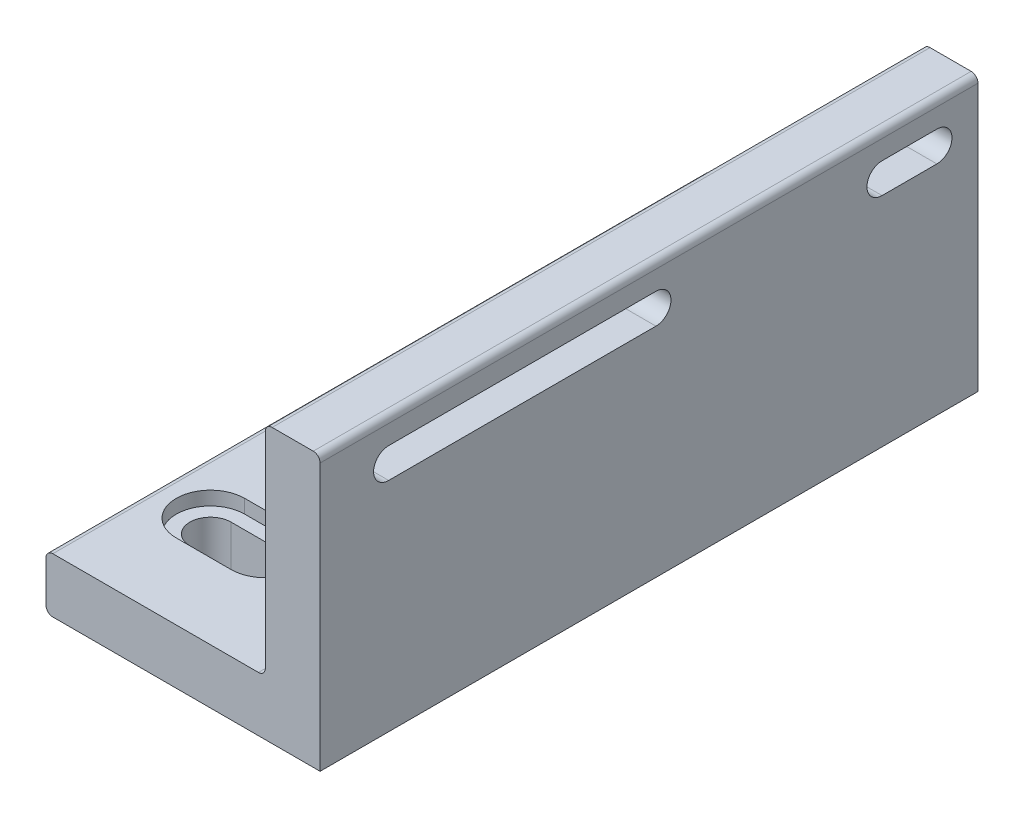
ISO-10303-21;
HEADER;
FILE_DESCRIPTION(('STEP AP214'),'2;1');
FILE_NAME('part.step','',(''),(''),'','','');
FILE_SCHEMA(('AUTOMOTIVE_DESIGN { 1 0 10303 214 1 1 1 1 }'));
ENDSEC;
DATA;
#1=APPLICATION_CONTEXT('core data for automotive mechanical design processes');
#2=APPLICATION_PROTOCOL_DEFINITION('international standard','automotive_design',2000,#1);
#3=PRODUCT_CONTEXT('',#1,'mechanical');
#4=PRODUCT('Part','Part','',(#3));
#5=PRODUCT_RELATED_PRODUCT_CATEGORY('part','',(#4));
#6=PRODUCT_DEFINITION_FORMATION('','',#4);
#7=PRODUCT_DEFINITION_CONTEXT('part definition',#1,'design');
#8=PRODUCT_DEFINITION('design','',#6,#7);
#9=PRODUCT_DEFINITION_SHAPE('','',#8);
#10=(LENGTH_UNIT() NAMED_UNIT(*) SI_UNIT(.MILLI.,.METRE.));
#11=(NAMED_UNIT(*) PLANE_ANGLE_UNIT() SI_UNIT($,.RADIAN.));
#12=(NAMED_UNIT(*) SI_UNIT($,.STERADIAN.) SOLID_ANGLE_UNIT());
#13=UNCERTAINTY_MEASURE_WITH_UNIT(LENGTH_MEASURE(1.E-05),#10,'distance_accuracy_value','');
#14=(GEOMETRIC_REPRESENTATION_CONTEXT(3) GLOBAL_UNCERTAINTY_ASSIGNED_CONTEXT((#13)) GLOBAL_UNIT_ASSIGNED_CONTEXT((#10,
#11,#12)) REPRESENTATION_CONTEXT('',''));
#15=CARTESIAN_POINT('',(0.,0.,0.));
#16=DIRECTION('',(0.,0.,1.));
#17=DIRECTION('',(1.,0.,0.));
#18=AXIS2_PLACEMENT_3D('',#15,#16,#17);
#19=CARTESIAN_POINT('',(-101.6,0.,101.6));
#20=DIRECTION('',(0.,1.,0.));
#21=DIRECTION('',(-1.,0.,0.));
#22=AXIS2_PLACEMENT_3D('',#19,#20,#21);
#23=CYLINDRICAL_SURFACE('',#22,9.52499999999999);
#24=CARTESIAN_POINT('',(-101.6,19.05,101.6));
#25=DIRECTION('',(0.,1.,0.));
#26=DIRECTION('',(-1.,0.,0.));
#27=AXIS2_PLACEMENT_3D('',#24,#25,#26);
#28=CIRCLE('',#27,9.52499999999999);
#29=CARTESIAN_POINT('',(-101.6,19.05,111.125));
#30=VERTEX_POINT('',#29);
#31=CARTESIAN_POINT('',(-101.6,19.05,92.075));
#32=VERTEX_POINT('',#31);
#33=EDGE_CURVE('E302',#30,#32,#28,.F.);
#34=ORIENTED_EDGE('',*,*,#33,.F.);
#35=DIRECTION('',(0.,1.,0.));
#36=VECTOR('',#35,1.);
#37=CARTESIAN_POINT('',(-101.6,0.,111.125));
#38=LINE('',#37,#36);
#39=CARTESIAN_POINT('',(-101.6,0.,111.125));
#40=VERTEX_POINT('',#39);
#41=EDGE_CURVE('E354',#40,#30,#38,.T.);
#42=ORIENTED_EDGE('',*,*,#41,.F.);
#43=CARTESIAN_POINT('',(-101.6,0.,101.6));
#44=DIRECTION('',(0.,1.,0.));
#45=DIRECTION('',(1.,0.,0.));
#46=AXIS2_PLACEMENT_3D('',#43,#44,#45);
#47=CIRCLE('',#46,9.52499999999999);
#48=CARTESIAN_POINT('',(-101.6,0.,92.075));
#49=VERTEX_POINT('',#48);
#50=EDGE_CURVE('E342',#49,#40,#47,.T.);
#51=ORIENTED_EDGE('',*,*,#50,.F.);
#52=DIRECTION('',(0.,1.,0.));
#53=VECTOR('',#52,1.);
#54=CARTESIAN_POINT('',(-101.6,0.,92.075));
#55=LINE('',#54,#53);
#56=EDGE_CURVE('E355',#49,#32,#55,.T.);
#57=ORIENTED_EDGE('',*,*,#56,.T.);
#58=EDGE_LOOP('',(#34,#42,#51,#57));
#59=FACE_BOUND('',#58,.T.);
#60=ADVANCED_FACE('F35',(#59),#23,.F.);
#61=CARTESIAN_POINT('',(-101.6,0.,92.075));
#62=DIRECTION('',(0.,0.,-1.));
#63=DIRECTION('',(-1.,0.,0.));
#64=AXIS2_PLACEMENT_3D('',#61,#62,#63);
#65=PLANE('',#64);
#66=DIRECTION('',(1.,0.,0.));
#67=VECTOR('',#66,1.);
#68=CARTESIAN_POINT('',(-101.6,19.05,92.075));
#69=LINE('',#68,#67);
#70=CARTESIAN_POINT('',(-76.1999999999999,19.05,92.075));
#71=VERTEX_POINT('',#70);
#72=EDGE_CURVE('E300',#32,#71,#69,.T.);
#73=ORIENTED_EDGE('',*,*,#72,.F.);
#74=ORIENTED_EDGE('',*,*,#56,.F.);
#75=DIRECTION('',(-1.,0.,0.));
#76=VECTOR('',#75,1.);
#77=CARTESIAN_POINT('',(-101.6,0.,92.075));
#78=LINE('',#77,#76);
#79=CARTESIAN_POINT('',(-76.1999999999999,0.,92.075));
#80=VERTEX_POINT('',#79);
#81=EDGE_CURVE('E351',#80,#49,#78,.T.);
#82=ORIENTED_EDGE('',*,*,#81,.F.);
#83=DIRECTION('',(0.,1.,0.));
#84=VECTOR('',#83,1.);
#85=CARTESIAN_POINT('',(-76.1999999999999,0.,92.075));
#86=LINE('',#85,#84);
#87=EDGE_CURVE('E359',#80,#71,#86,.T.);
#88=ORIENTED_EDGE('',*,*,#87,.T.);
#89=EDGE_LOOP('',(#73,#74,#82,#88));
#90=FACE_BOUND('',#89,.T.);
#91=ADVANCED_FACE('F562',(#90),#65,.F.);
#92=CARTESIAN_POINT('',(-76.2,0.,101.6));
#93=DIRECTION('',(0.,1.,0.));
#94=DIRECTION('',(-1.,0.,0.));
#95=AXIS2_PLACEMENT_3D('',#92,#93,#94);
#96=CYLINDRICAL_SURFACE('',#95,9.52499999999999);
#97=CARTESIAN_POINT('',(-76.2,19.05,101.6));
#98=DIRECTION('',(0.,1.,0.));
#99=DIRECTION('',(-1.,0.,0.));
#100=AXIS2_PLACEMENT_3D('',#97,#98,#99);
#101=CIRCLE('',#100,9.52499999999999);
#102=CARTESIAN_POINT('',(-76.1999999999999,19.05,111.125));
#103=VERTEX_POINT('',#102);
#104=EDGE_CURVE('E57',#71,#103,#101,.F.);
#105=ORIENTED_EDGE('',*,*,#104,.F.);
#106=ORIENTED_EDGE('',*,*,#87,.F.);
#107=CARTESIAN_POINT('',(-76.2,0.,101.6));
#108=DIRECTION('',(0.,1.,0.));
#109=DIRECTION('',(1.,0.,0.));
#110=AXIS2_PLACEMENT_3D('',#107,#108,#109);
#111=CIRCLE('',#110,9.52499999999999);
#112=CARTESIAN_POINT('',(-76.1999999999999,0.,111.125));
#113=VERTEX_POINT('',#112);
#114=EDGE_CURVE('E348',#113,#80,#111,.T.);
#115=ORIENTED_EDGE('',*,*,#114,.F.);
#116=DIRECTION('',(0.,1.,0.));
#117=VECTOR('',#116,1.);
#118=CARTESIAN_POINT('',(-76.1999999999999,0.,111.125));
#119=LINE('',#118,#117);
#120=EDGE_CURVE('E362',#113,#103,#119,.T.);
#121=ORIENTED_EDGE('',*,*,#120,.T.);
#122=EDGE_LOOP('',(#105,#106,#115,#121));
#123=FACE_BOUND('',#122,.T.);
#124=ADVANCED_FACE('F568',(#123),#96,.F.);
#125=CARTESIAN_POINT('',(-101.6,0.,111.125));
#126=DIRECTION('',(0.,0.,1.));
#127=DIRECTION('',(1.,0.,0.));
#128=AXIS2_PLACEMENT_3D('',#125,#126,#127);
#129=PLANE('',#128);
#130=DIRECTION('',(-1.,0.,0.));
#131=VECTOR('',#130,1.);
#132=CARTESIAN_POINT('',(-101.6,19.05,111.125));
#133=LINE('',#132,#131);
#134=EDGE_CURVE('E11',#103,#30,#133,.T.);
#135=ORIENTED_EDGE('',*,*,#134,.F.);
#136=ORIENTED_EDGE('',*,*,#120,.F.);
#137=DIRECTION('',(1.,0.,0.));
#138=VECTOR('',#137,1.);
#139=CARTESIAN_POINT('',(-101.6,0.,111.125));
#140=LINE('',#139,#138);
#141=EDGE_CURVE('E345',#40,#113,#140,.T.);
#142=ORIENTED_EDGE('',*,*,#141,.F.);
#143=ORIENTED_EDGE('',*,*,#41,.T.);
#144=EDGE_LOOP('',(#135,#136,#142,#143));
#145=FACE_BOUND('',#144,.T.);
#146=ADVANCED_FACE('F573',(#145),#129,.F.);
#147=CARTESIAN_POINT('',(-101.6,0.,-101.6));
#148=DIRECTION('',(0.,1.,0.));
#149=DIRECTION('',(-1.,0.,0.));
#150=AXIS2_PLACEMENT_3D('',#147,#148,#149);
#151=CYLINDRICAL_SURFACE('',#150,9.52499999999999);
#152=CARTESIAN_POINT('',(-101.6,19.05,-101.6));
#153=DIRECTION('',(0.,1.,0.));
#154=DIRECTION('',(-1.,0.,0.));
#155=AXIS2_PLACEMENT_3D('',#152,#153,#154);
#156=CIRCLE('',#155,9.52499999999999);
#157=CARTESIAN_POINT('',(-101.6,19.05,-92.075));
#158=VERTEX_POINT('',#157);
#159=CARTESIAN_POINT('',(-101.6,19.05,-111.125));
#160=VERTEX_POINT('',#159);
#161=EDGE_CURVE('E340',#158,#160,#156,.F.);
#162=ORIENTED_EDGE('',*,*,#161,.F.);
#163=DIRECTION('',(0.,1.,0.));
#164=VECTOR('',#163,1.);
#165=CARTESIAN_POINT('',(-101.6,0.,-92.075));
#166=LINE('',#165,#164);
#167=CARTESIAN_POINT('',(-101.6,0.,-92.075));
#168=VERTEX_POINT('',#167);
#169=EDGE_CURVE('E378',#168,#158,#166,.T.);
#170=ORIENTED_EDGE('',*,*,#169,.F.);
#171=CARTESIAN_POINT('',(-101.6,0.,-101.6));
#172=DIRECTION('',(0.,1.,0.));
#173=DIRECTION('',(-1.,0.,0.));
#174=AXIS2_PLACEMENT_3D('',#171,#172,#173);
#175=CIRCLE('',#174,9.52499999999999);
#176=CARTESIAN_POINT('',(-101.6,0.,-111.125));
#177=VERTEX_POINT('',#176);
#178=EDGE_CURVE('E358',#177,#168,#175,.T.);
#179=ORIENTED_EDGE('',*,*,#178,.F.);
#180=DIRECTION('',(0.,1.,0.));
#181=VECTOR('',#180,1.);
#182=CARTESIAN_POINT('',(-101.6,0.,-111.125));
#183=LINE('',#182,#181);
#184=EDGE_CURVE('E379',#177,#160,#183,.T.);
#185=ORIENTED_EDGE('',*,*,#184,.T.);
#186=EDGE_LOOP('',(#162,#170,#179,#185));
#187=FACE_BOUND('',#186,.T.);
#188=ADVANCED_FACE('F541',(#187),#151,.F.);
#189=CARTESIAN_POINT('',(-101.6,0.,-111.125));
#190=DIRECTION('',(0.,0.,-1.));
#191=DIRECTION('',(-1.,0.,0.));
#192=AXIS2_PLACEMENT_3D('',#189,#190,#191);
#193=PLANE('',#192);
#194=DIRECTION('',(1.,0.,0.));
#195=VECTOR('',#194,1.);
#196=CARTESIAN_POINT('',(-101.6,19.05,-111.125));
#197=LINE('',#196,#195);
#198=CARTESIAN_POINT('',(-76.1999999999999,19.05,-111.125));
#199=VERTEX_POINT('',#198);
#200=EDGE_CURVE('E338',#160,#199,#197,.T.);
#201=ORIENTED_EDGE('',*,*,#200,.F.);
#202=ORIENTED_EDGE('',*,*,#184,.F.);
#203=DIRECTION('',(-1.,0.,0.));
#204=VECTOR('',#203,1.);
#205=CARTESIAN_POINT('',(-101.6,0.,-111.125));
#206=LINE('',#205,#204);
#207=CARTESIAN_POINT('',(-76.1999999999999,0.,-111.125));
#208=VERTEX_POINT('',#207);
#209=EDGE_CURVE('E375',#208,#177,#206,.T.);
#210=ORIENTED_EDGE('',*,*,#209,.F.);
#211=DIRECTION('',(0.,1.,0.));
#212=VECTOR('',#211,1.);
#213=CARTESIAN_POINT('',(-76.1999999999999,0.,-111.125));
#214=LINE('',#213,#212);
#215=EDGE_CURVE('E383',#208,#199,#214,.T.);
#216=ORIENTED_EDGE('',*,*,#215,.T.);
#217=EDGE_LOOP('',(#201,#202,#210,#216));
#218=FACE_BOUND('',#217,.T.);
#219=ADVANCED_FACE('F550',(#218),#193,.F.);
#220=CARTESIAN_POINT('',(-76.2,0.,-101.6));
#221=DIRECTION('',(0.,1.,0.));
#222=DIRECTION('',(-1.,0.,0.));
#223=AXIS2_PLACEMENT_3D('',#220,#221,#222);
#224=CYLINDRICAL_SURFACE('',#223,9.52499999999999);
#225=CARTESIAN_POINT('',(-76.2,19.05,-101.6));
#226=DIRECTION('',(0.,1.,0.));
#227=DIRECTION('',(-1.,0.,0.));
#228=AXIS2_PLACEMENT_3D('',#225,#226,#227);
#229=CIRCLE('',#228,9.52499999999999);
#230=CARTESIAN_POINT('',(-76.1999999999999,19.05,-92.075));
#231=VERTEX_POINT('',#230);
#232=EDGE_CURVE('E330',#199,#231,#229,.F.);
#233=ORIENTED_EDGE('',*,*,#232,.F.);
#234=ORIENTED_EDGE('',*,*,#215,.F.);
#235=CARTESIAN_POINT('',(-76.2,0.,-101.6));
#236=DIRECTION('',(0.,1.,0.));
#237=DIRECTION('',(-1.,0.,0.));
#238=AXIS2_PLACEMENT_3D('',#235,#236,#237);
#239=CIRCLE('',#238,9.52499999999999);
#240=CARTESIAN_POINT('',(-76.1999999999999,0.,-92.075));
#241=VERTEX_POINT('',#240);
#242=EDGE_CURVE('E372',#241,#208,#239,.T.);
#243=ORIENTED_EDGE('',*,*,#242,.F.);
#244=DIRECTION('',(0.,1.,0.));
#245=VECTOR('',#244,1.);
#246=CARTESIAN_POINT('',(-76.1999999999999,0.,-92.075));
#247=LINE('',#246,#245);
#248=EDGE_CURVE('E386',#241,#231,#247,.T.);
#249=ORIENTED_EDGE('',*,*,#248,.T.);
#250=EDGE_LOOP('',(#233,#234,#243,#249));
#251=FACE_BOUND('',#250,.T.);
#252=ADVANCED_FACE('F552',(#251),#224,.F.);
#253=CARTESIAN_POINT('',(-101.6,0.,-92.075));
#254=DIRECTION('',(0.,0.,1.));
#255=DIRECTION('',(1.,0.,0.));
#256=AXIS2_PLACEMENT_3D('',#253,#254,#255);
#257=PLANE('',#256);
#258=DIRECTION('',(-1.,0.,0.));
#259=VECTOR('',#258,1.);
#260=CARTESIAN_POINT('',(-101.6,19.05,-92.075));
#261=LINE('',#260,#259);
#262=EDGE_CURVE('E43',#231,#158,#261,.T.);
#263=ORIENTED_EDGE('',*,*,#262,.F.);
#264=ORIENTED_EDGE('',*,*,#248,.F.);
#265=DIRECTION('',(1.,0.,0.));
#266=VECTOR('',#265,1.);
#267=CARTESIAN_POINT('',(-101.6,0.,-92.075));
#268=LINE('',#267,#266);
#269=EDGE_CURVE('E369',#168,#241,#268,.T.);
#270=ORIENTED_EDGE('',*,*,#269,.F.);
#271=ORIENTED_EDGE('',*,*,#169,.T.);
#272=EDGE_LOOP('',(#263,#264,#270,#271));
#273=FACE_BOUND('',#272,.T.);
#274=ADVANCED_FACE('F544',(#273),#257,.F.);
#275=CARTESIAN_POINT('',(0.,123.701968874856,152.4));
#276=DIRECTION('',(-1.,0.,0.));
#277=DIRECTION('',(0.,0.,1.));
#278=AXIS2_PLACEMENT_3D('',#275,#276,#277);
#279=PLANE('',#278);
#280=DIRECTION('',(0.,0.,1.));
#281=VECTOR('',#280,1.);
#282=CARTESIAN_POINT('',(0.,114.811968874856,-107.95));
#283=LINE('',#282,#281);
#284=CARTESIAN_POINT('',(0.,114.811968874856,-133.35));
#285=VERTEX_POINT('',#284);
#286=CARTESIAN_POINT('',(0.,114.811968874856,-107.95));
#287=VERTEX_POINT('',#286);
#288=EDGE_CURVE('E392',#285,#287,#283,.T.);
#289=ORIENTED_EDGE('',*,*,#288,.F.);
#290=CARTESIAN_POINT('',(0.,107.826968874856,-133.35));
#291=DIRECTION('',(1.,0.,0.));
#292=DIRECTION('',(0.,0.,-1.));
#293=AXIS2_PLACEMENT_3D('',#290,#291,#292);
#294=CIRCLE('',#293,6.98500000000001);
#295=CARTESIAN_POINT('',(0.,100.841968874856,-133.35));
#296=VERTEX_POINT('',#295);
#297=EDGE_CURVE('E382',#296,#285,#294,.T.);
#298=ORIENTED_EDGE('',*,*,#297,.F.);
#299=DIRECTION('',(0.,0.,-1.));
#300=VECTOR('',#299,1.);
#301=CARTESIAN_POINT('',(0.,100.841968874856,-107.95));
#302=LINE('',#301,#300);
#303=CARTESIAN_POINT('',(0.,100.841968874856,-107.95));
#304=VERTEX_POINT('',#303);
#305=EDGE_CURVE('E398',#304,#296,#302,.T.);
#306=ORIENTED_EDGE('',*,*,#305,.F.);
#307=CARTESIAN_POINT('',(0.,107.826968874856,-107.95));
#308=DIRECTION('',(1.,0.,0.));
#309=DIRECTION('',(0.,0.,-1.));
#310=AXIS2_PLACEMENT_3D('',#307,#308,#309);
#311=CIRCLE('',#310,6.985);
#312=EDGE_CURVE('E395',#287,#304,#311,.T.);
#313=ORIENTED_EDGE('',*,*,#312,.F.);
#314=EDGE_LOOP('',(#289,#298,#306,#313));
#315=FACE_BOUND('',#314,.T.);
#316=DIRECTION('',(0.,0.,-1.));
#317=VECTOR('',#316,1.);
#318=CARTESIAN_POINT('',(0.,100.841968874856,120.65));
#319=LINE('',#318,#317);
#320=CARTESIAN_POINT('',(0.,100.841968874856,120.65));
#321=VERTEX_POINT('',#320);
#322=CARTESIAN_POINT('',(0.,100.841968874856,-3.175));
#323=VERTEX_POINT('',#322);
#324=EDGE_CURVE('E412',#321,#323,#319,.T.);
#325=ORIENTED_EDGE('',*,*,#324,.F.);
#326=CARTESIAN_POINT('',(0.,107.826968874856,120.65));
#327=DIRECTION('',(1.,0.,0.));
#328=DIRECTION('',(0.,0.,-1.));
#329=AXIS2_PLACEMENT_3D('',#326,#327,#328);
#330=CIRCLE('',#329,6.985);
#331=CARTESIAN_POINT('',(0.,114.811968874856,120.65));
#332=VERTEX_POINT('',#331);
#333=EDGE_CURVE('E404',#332,#321,#330,.T.);
#334=ORIENTED_EDGE('',*,*,#333,.F.);
#335=DIRECTION('',(0.,0.,1.));
#336=VECTOR('',#335,1.);
#337=CARTESIAN_POINT('',(0.,114.811968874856,120.65));
#338=LINE('',#337,#336);
#339=CARTESIAN_POINT('',(0.,114.811968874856,-3.175));
#340=VERTEX_POINT('',#339);
#341=EDGE_CURVE('E418',#340,#332,#338,.T.);
#342=ORIENTED_EDGE('',*,*,#341,.F.);
#343=CARTESIAN_POINT('',(0.,107.826968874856,-3.175));
#344=DIRECTION('',(1.,0.,0.));
#345=DIRECTION('',(0.,0.,1.));
#346=AXIS2_PLACEMENT_3D('',#343,#344,#345);
#347=CIRCLE('',#346,6.985);
#348=EDGE_CURVE('E415',#323,#340,#347,.T.);
#349=ORIENTED_EDGE('',*,*,#348,.F.);
#350=EDGE_LOOP('',(#325,#334,#342,#349));
#351=FACE_BOUND('',#350,.T.);
#352=DIRECTION('',(0.,1.,0.));
#353=VECTOR('',#352,1.);
#354=CARTESIAN_POINT('',(0.,123.701968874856,-152.4));
#355=LINE('',#354,#353);
#356=CARTESIAN_POINT('',(0.,0.,-152.4));
#357=VERTEX_POINT('',#356);
#358=CARTESIAN_POINT('',(0.,123.701968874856,-152.4));
#359=VERTEX_POINT('',#358);
#360=EDGE_CURVE('E424',#357,#359,#355,.T.);
#361=ORIENTED_EDGE('',*,*,#360,.T.);
#362=DIRECTION('',(0.,0.,-1.));
#363=VECTOR('',#362,1.);
#364=CARTESIAN_POINT('',(0.,123.701968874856,152.4));
#365=LINE('',#364,#363);
#366=CARTESIAN_POINT('',(0.,123.701968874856,152.4));
#367=VERTEX_POINT('',#366);
#368=EDGE_CURVE('E506',#367,#359,#365,.T.);
#369=ORIENTED_EDGE('',*,*,#368,.F.);
#370=DIRECTION('',(0.,1.,0.));
#371=VECTOR('',#370,1.);
#372=CARTESIAN_POINT('',(0.,123.701968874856,152.4));
#373=LINE('',#372,#371);
#374=CARTESIAN_POINT('',(0.,0.,152.4));
#375=VERTEX_POINT('',#374);
#376=EDGE_CURVE('E431',#375,#367,#373,.T.);
#377=ORIENTED_EDGE('',*,*,#376,.F.);
#378=DIRECTION('',(0.,0.,-1.));
#379=VECTOR('',#378,1.);
#380=CARTESIAN_POINT('',(0.,0.,152.4));
#381=LINE('',#380,#379);
#382=EDGE_CURVE('E455',#375,#357,#381,.T.);
#383=ORIENTED_EDGE('',*,*,#382,.T.);
#384=EDGE_LOOP('',(#361,#369,#377,#383));
#385=FACE_BOUND('',#384,.T.);
#386=ADVANCED_FACE('F37',(#315,#351,#385),#279,.F.);
#387=CARTESIAN_POINT('',(-3.175,123.701968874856,152.4));
#388=DIRECTION('',(0.,0.,-1.));
#389=DIRECTION('',(-1.,0.,0.));
#390=AXIS2_PLACEMENT_3D('',#387,#388,#389);
#391=CYLINDRICAL_SURFACE('',#390,3.175);
#392=CARTESIAN_POINT('',(-3.175,123.701968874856,-152.4));
#393=DIRECTION('',(0.,0.,1.));
#394=DIRECTION('',(-1.,0.,0.));
#395=AXIS2_PLACEMENT_3D('',#392,#393,#394);
#396=CIRCLE('',#395,3.175);
#397=CARTESIAN_POINT('',(-3.175,126.876968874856,-152.4));
#398=VERTEX_POINT('',#397);
#399=EDGE_CURVE('E458',#359,#398,#396,.T.);
#400=ORIENTED_EDGE('',*,*,#399,.T.);
#401=DIRECTION('',(0.,0.,-1.));
#402=VECTOR('',#401,1.);
#403=CARTESIAN_POINT('',(-3.175,126.876968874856,152.4));
#404=LINE('',#403,#402);
#405=CARTESIAN_POINT('',(-3.175,126.876968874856,152.4));
#406=VERTEX_POINT('',#405);
#407=EDGE_CURVE('E503',#406,#398,#404,.T.);
#408=ORIENTED_EDGE('',*,*,#407,.F.);
#409=CARTESIAN_POINT('',(-3.175,123.701968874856,152.4));
#410=DIRECTION('',(0.,0.,1.));
#411=DIRECTION('',(-1.,0.,0.));
#412=AXIS2_PLACEMENT_3D('',#409,#410,#411);
#413=CIRCLE('',#412,3.175);
#414=EDGE_CURVE('E434',#367,#406,#413,.T.);
#415=ORIENTED_EDGE('',*,*,#414,.F.);
#416=ORIENTED_EDGE('',*,*,#368,.T.);
#417=EDGE_LOOP('',(#400,#408,#415,#416));
#418=FACE_BOUND('',#417,.T.);
#419=ADVANCED_FACE('F877',(#418),#391,.T.);
#420=CARTESIAN_POINT('',(-22.225,126.876968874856,152.4));
#421=DIRECTION('',(0.,-1.,0.));
#422=DIRECTION('',(0.,0.,-1.));
#423=AXIS2_PLACEMENT_3D('',#420,#421,#422);
#424=PLANE('',#423);
#425=DIRECTION('',(-1.,0.,0.));
#426=VECTOR('',#425,1.);
#427=CARTESIAN_POINT('',(-22.225,126.876968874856,-152.4));
#428=LINE('',#427,#426);
#429=CARTESIAN_POINT('',(-22.225,126.876968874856,-152.4));
#430=VERTEX_POINT('',#429);
#431=EDGE_CURVE('E460',#398,#430,#428,.T.);
#432=ORIENTED_EDGE('',*,*,#431,.T.);
#433=DIRECTION('',(0.,0.,-1.));
#434=VECTOR('',#433,1.);
#435=CARTESIAN_POINT('',(-22.225,126.876968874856,152.4));
#436=LINE('',#435,#434);
#437=CARTESIAN_POINT('',(-22.225,126.876968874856,152.4));
#438=VERTEX_POINT('',#437);
#439=EDGE_CURVE('E500',#438,#430,#436,.T.);
#440=ORIENTED_EDGE('',*,*,#439,.F.);
#441=DIRECTION('',(-1.,0.,0.));
#442=VECTOR('',#441,1.);
#443=CARTESIAN_POINT('',(-22.225,126.876968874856,152.4));
#444=LINE('',#443,#442);
#445=EDGE_CURVE('E437',#406,#438,#444,.T.);
#446=ORIENTED_EDGE('',*,*,#445,.F.);
#447=ORIENTED_EDGE('',*,*,#407,.T.);
#448=EDGE_LOOP('',(#432,#440,#446,#447));
#449=FACE_BOUND('',#448,.T.);
#450=ADVANCED_FACE('F868',(#449),#424,.F.);
#451=CARTESIAN_POINT('',(-22.225,123.701968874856,152.4));
#452=DIRECTION('',(0.,0.,-1.));
#453=DIRECTION('',(-1.,0.,0.));
#454=AXIS2_PLACEMENT_3D('',#451,#452,#453);
#455=CYLINDRICAL_SURFACE('',#454,3.175);
#456=CARTESIAN_POINT('',(-22.225,123.701968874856,-152.4));
#457=DIRECTION('',(0.,0.,1.));
#458=DIRECTION('',(-1.,0.,0.));
#459=AXIS2_PLACEMENT_3D('',#456,#457,#458);
#460=CIRCLE('',#459,3.175);
#461=CARTESIAN_POINT('',(-25.4,123.701968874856,-152.4));
#462=VERTEX_POINT('',#461);
#463=EDGE_CURVE('E462',#430,#462,#460,.T.);
#464=ORIENTED_EDGE('',*,*,#463,.T.);
#465=DIRECTION('',(0.,0.,-1.));
#466=VECTOR('',#465,1.);
#467=CARTESIAN_POINT('',(-25.4,123.701968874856,152.4));
#468=LINE('',#467,#466);
#469=CARTESIAN_POINT('',(-25.4,123.701968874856,152.4));
#470=VERTEX_POINT('',#469);
#471=EDGE_CURVE('E497',#470,#462,#468,.T.);
#472=ORIENTED_EDGE('',*,*,#471,.F.);
#473=CARTESIAN_POINT('',(-22.225,123.701968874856,152.4));
#474=DIRECTION('',(0.,0.,1.));
#475=DIRECTION('',(-1.,0.,0.));
#476=AXIS2_PLACEMENT_3D('',#473,#474,#475);
#477=CIRCLE('',#476,3.175);
#478=EDGE_CURVE('E439',#438,#470,#477,.T.);
#479=ORIENTED_EDGE('',*,*,#478,.F.);
#480=ORIENTED_EDGE('',*,*,#439,.T.);
#481=EDGE_LOOP('',(#464,#472,#479,#480));
#482=FACE_BOUND('',#481,.T.);
#483=ADVANCED_FACE('F860',(#482),#455,.T.);
#484=CARTESIAN_POINT('',(-25.4,28.575,152.4));
#485=DIRECTION('',(1.,0.,0.));
#486=DIRECTION('',(0.,0.,-1.));
#487=AXIS2_PLACEMENT_3D('',#484,#485,#486);
#488=PLANE('',#487);
#489=DIRECTION('',(0.,0.,-1.));
#490=VECTOR('',#489,1.);
#491=CARTESIAN_POINT('',(-25.4,100.841968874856,152.4));
#492=LINE('',#491,#490);
#493=CARTESIAN_POINT('',(-25.4,100.841968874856,-107.95));
#494=VERTEX_POINT('',#493);
#495=CARTESIAN_POINT('',(-25.4,100.841968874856,-133.35));
#496=VERTEX_POINT('',#495);
#497=EDGE_CURVE('E527',#494,#496,#492,.T.);
#498=ORIENTED_EDGE('',*,*,#497,.T.);
#499=CARTESIAN_POINT('',(-25.4,107.826968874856,-133.35));
#500=DIRECTION('',(1.,0.,0.));
#501=DIRECTION('',(0.,0.,-1.));
#502=AXIS2_PLACEMENT_3D('',#499,#500,#501);
#503=CIRCLE('',#502,6.98500000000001);
#504=CARTESIAN_POINT('',(-25.4,114.811968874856,-133.35));
#505=VERTEX_POINT('',#504);
#506=EDGE_CURVE('E530',#496,#505,#503,.T.);
#507=ORIENTED_EDGE('',*,*,#506,.T.);
#508=DIRECTION('',(0.,0.,1.));
#509=VECTOR('',#508,1.);
#510=CARTESIAN_POINT('',(-25.4,114.811968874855,152.4));
#511=LINE('',#510,#509);
#512=CARTESIAN_POINT('',(-25.4,114.811968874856,-107.95));
#513=VERTEX_POINT('',#512);
#514=EDGE_CURVE('E521',#505,#513,#511,.T.);
#515=ORIENTED_EDGE('',*,*,#514,.T.);
#516=CARTESIAN_POINT('',(-25.4,107.826968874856,-107.95));
#517=DIRECTION('',(1.,0.,0.));
#518=DIRECTION('',(0.,0.,-1.));
#519=AXIS2_PLACEMENT_3D('',#516,#517,#518);
#520=CIRCLE('',#519,6.985);
#521=EDGE_CURVE('E524',#513,#494,#520,.T.);
#522=ORIENTED_EDGE('',*,*,#521,.T.);
#523=EDGE_LOOP('',(#498,#507,#515,#522));
#524=FACE_BOUND('',#523,.T.);
#525=DIRECTION('',(0.,0.,1.));
#526=VECTOR('',#525,1.);
#527=CARTESIAN_POINT('',(-25.4,114.811968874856,152.4));
#528=LINE('',#527,#526);
#529=CARTESIAN_POINT('',(-25.4,114.811968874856,-3.175));
#530=VERTEX_POINT('',#529);
#531=CARTESIAN_POINT('',(-25.4,114.811968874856,120.65));
#532=VERTEX_POINT('',#531);
#533=EDGE_CURVE('E515',#530,#532,#528,.T.);
#534=ORIENTED_EDGE('',*,*,#533,.T.);
#535=CARTESIAN_POINT('',(-25.4,107.826968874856,120.65));
#536=DIRECTION('',(1.,0.,0.));
#537=DIRECTION('',(0.,0.,-1.));
#538=AXIS2_PLACEMENT_3D('',#535,#536,#537);
#539=CIRCLE('',#538,6.985);
#540=CARTESIAN_POINT('',(-25.4,100.841968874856,120.65));
#541=VERTEX_POINT('',#540);
#542=EDGE_CURVE('E518',#532,#541,#539,.T.);
#543=ORIENTED_EDGE('',*,*,#542,.T.);
#544=DIRECTION('',(0.,0.,-1.));
#545=VECTOR('',#544,1.);
#546=CARTESIAN_POINT('',(-25.4,100.841968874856,152.4));
#547=LINE('',#546,#545);
#548=CARTESIAN_POINT('',(-25.4,100.841968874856,-3.17499999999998));
#549=VERTEX_POINT('',#548);
#550=EDGE_CURVE('E509',#541,#549,#547,.T.);
#551=ORIENTED_EDGE('',*,*,#550,.T.);
#552=CARTESIAN_POINT('',(-25.4,107.826968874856,-3.175));
#553=DIRECTION('',(1.,0.,0.));
#554=DIRECTION('',(0.,0.,-1.));
#555=AXIS2_PLACEMENT_3D('',#552,#553,#554);
#556=CIRCLE('',#555,6.985);
#557=EDGE_CURVE('E512',#549,#530,#556,.T.);
#558=ORIENTED_EDGE('',*,*,#557,.T.);
#559=EDGE_LOOP('',(#534,#543,#551,#558));
#560=FACE_BOUND('',#559,.T.);
#561=DIRECTION('',(0.,-1.,0.));
#562=VECTOR('',#561,1.);
#563=CARTESIAN_POINT('',(-25.4,28.575,-152.4));
#564=LINE('',#563,#562);
#565=CARTESIAN_POINT('',(-25.4,28.575,-152.4));
#566=VERTEX_POINT('',#565);
#567=EDGE_CURVE('E464',#462,#566,#564,.T.);
#568=ORIENTED_EDGE('',*,*,#567,.T.);
#569=DIRECTION('',(0.,0.,-1.));
#570=VECTOR('',#569,1.);
#571=CARTESIAN_POINT('',(-25.4,28.575,152.4));
#572=LINE('',#571,#570);
#573=CARTESIAN_POINT('',(-25.4,28.575,152.4));
#574=VERTEX_POINT('',#573);
#575=EDGE_CURVE('E494',#574,#566,#572,.T.);
#576=ORIENTED_EDGE('',*,*,#575,.F.);
#577=DIRECTION('',(0.,-1.,0.));
#578=VECTOR('',#577,1.);
#579=CARTESIAN_POINT('',(-25.4,28.575,152.4));
#580=LINE('',#579,#578);
#581=EDGE_CURVE('E441',#470,#574,#580,.T.);
#582=ORIENTED_EDGE('',*,*,#581,.F.);
#583=ORIENTED_EDGE('',*,*,#471,.T.);
#584=EDGE_LOOP('',(#568,#576,#582,#583));
#585=FACE_BOUND('',#584,.T.);
#586=ADVANCED_FACE('F851',(#524,#560,#585),#488,.F.);
#587=CARTESIAN_POINT('',(-28.575,28.575,152.4));
#588=DIRECTION('',(0.,0.,-1.));
#589=DIRECTION('',(-1.,0.,0.));
#590=AXIS2_PLACEMENT_3D('',#587,#588,#589);
#591=CYLINDRICAL_SURFACE('',#590,3.175);
#592=CARTESIAN_POINT('',(-28.575,28.575,-152.4));
#593=DIRECTION('',(0.,0.,-1.));
#594=DIRECTION('',(1.,0.,0.));
#595=AXIS2_PLACEMENT_3D('',#592,#593,#594);
#596=CIRCLE('',#595,3.175);
#597=CARTESIAN_POINT('',(-28.575,25.4,-152.4));
#598=VERTEX_POINT('',#597);
#599=EDGE_CURVE('E466',#566,#598,#596,.T.);
#600=ORIENTED_EDGE('',*,*,#599,.T.);
#601=DIRECTION('',(0.,0.,-1.));
#602=VECTOR('',#601,1.);
#603=CARTESIAN_POINT('',(-28.575,25.4,152.4));
#604=LINE('',#603,#602);
#605=CARTESIAN_POINT('',(-28.575,25.4,152.4));
#606=VERTEX_POINT('',#605);
#607=EDGE_CURVE('E491',#606,#598,#604,.T.);
#608=ORIENTED_EDGE('',*,*,#607,.F.);
#609=CARTESIAN_POINT('',(-28.575,28.575,152.4));
#610=DIRECTION('',(0.,0.,-1.));
#611=DIRECTION('',(1.,0.,0.));
#612=AXIS2_PLACEMENT_3D('',#609,#610,#611);
#613=CIRCLE('',#612,3.175);
#614=EDGE_CURVE('E443',#574,#606,#613,.T.);
#615=ORIENTED_EDGE('',*,*,#614,.F.);
#616=ORIENTED_EDGE('',*,*,#575,.T.);
#617=EDGE_LOOP('',(#600,#608,#615,#616));
#618=FACE_BOUND('',#617,.T.);
#619=ADVANCED_FACE('F843',(#618),#591,.F.);
#620=CARTESIAN_POINT('',(-28.575,25.4,152.4));
#621=DIRECTION('',(0.,-1.,0.));
#622=DIRECTION('',(1.,0.,0.));
#623=AXIS2_PLACEMENT_3D('',#620,#621,#622);
#624=PLANE('',#623);
#625=DIRECTION('',(1.,0.,0.));
#626=VECTOR('',#625,1.);
#627=CARTESIAN_POINT('',(-101.6,25.4,117.475));
#628=LINE('',#627,#626);
#629=CARTESIAN_POINT('',(-101.6,25.4,117.475));
#630=VERTEX_POINT('',#629);
#631=CARTESIAN_POINT('',(-76.1999999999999,25.4,117.475));
#632=VERTEX_POINT('',#631);
#633=EDGE_CURVE('E290',#630,#632,#628,.T.);
#634=ORIENTED_EDGE('',*,*,#633,.F.);
#635=CARTESIAN_POINT('',(-101.6,25.4,101.6));
#636=DIRECTION('',(0.,1.,0.));
#637=DIRECTION('',(-1.,0.,0.));
#638=AXIS2_PLACEMENT_3D('',#635,#636,#637);
#639=CIRCLE('',#638,15.875);
#640=CARTESIAN_POINT('',(-101.6,25.4,85.725));
#641=VERTEX_POINT('',#640);
#642=EDGE_CURVE('E50',#641,#630,#639,.T.);
#643=ORIENTED_EDGE('',*,*,#642,.F.);
#644=DIRECTION('',(-1.,0.,0.));
#645=VECTOR('',#644,1.);
#646=CARTESIAN_POINT('',(-76.1999999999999,25.4,85.725));
#647=LINE('',#646,#645);
#648=CARTESIAN_POINT('',(-76.1999999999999,25.4,85.725));
#649=VERTEX_POINT('',#648);
#650=EDGE_CURVE('E281',#649,#641,#647,.T.);
#651=ORIENTED_EDGE('',*,*,#650,.F.);
#652=CARTESIAN_POINT('',(-76.2,25.4,101.6));
#653=DIRECTION('',(0.,1.,0.));
#654=DIRECTION('',(-1.,0.,0.));
#655=AXIS2_PLACEMENT_3D('',#652,#653,#654);
#656=CIRCLE('',#655,15.875);
#657=EDGE_CURVE('E284',#632,#649,#656,.T.);
#658=ORIENTED_EDGE('',*,*,#657,.F.);
#659=EDGE_LOOP('',(#634,#643,#651,#658));
#660=FACE_BOUND('',#659,.T.);
#661=DIRECTION('',(1.,0.,0.));
#662=VECTOR('',#661,1.);
#663=CARTESIAN_POINT('',(-101.6,25.4,-85.725));
#664=LINE('',#663,#662);
#665=CARTESIAN_POINT('',(-101.6,25.4,-85.725));
#666=VERTEX_POINT('',#665);
#667=CARTESIAN_POINT('',(-76.1999999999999,25.4,-85.725));
#668=VERTEX_POINT('',#667);
#669=EDGE_CURVE('E320',#666,#668,#664,.T.);
#670=ORIENTED_EDGE('',*,*,#669,.F.);
#671=CARTESIAN_POINT('',(-101.6,25.4,-101.6));
#672=DIRECTION('',(0.,1.,0.));
#673=DIRECTION('',(-1.,0.,0.));
#674=AXIS2_PLACEMENT_3D('',#671,#672,#673);
#675=CIRCLE('',#674,15.875);
#676=CARTESIAN_POINT('',(-101.6,25.4,-117.475));
#677=VERTEX_POINT('',#676);
#678=EDGE_CURVE('E304',#677,#666,#675,.T.);
#679=ORIENTED_EDGE('',*,*,#678,.F.);
#680=DIRECTION('',(-1.,0.,0.));
#681=VECTOR('',#680,1.);
#682=CARTESIAN_POINT('',(-76.1999999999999,25.4,-117.475));
#683=LINE('',#682,#681);
#684=CARTESIAN_POINT('',(-76.1999999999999,25.4,-117.475));
#685=VERTEX_POINT('',#684);
#686=EDGE_CURVE('E309',#685,#677,#683,.T.);
#687=ORIENTED_EDGE('',*,*,#686,.F.);
#688=CARTESIAN_POINT('',(-76.2,25.4,-101.6));
#689=DIRECTION('',(0.,1.,0.));
#690=DIRECTION('',(-1.,0.,0.));
#691=AXIS2_PLACEMENT_3D('',#688,#689,#690);
#692=CIRCLE('',#691,15.875);
#693=EDGE_CURVE('E323',#668,#685,#692,.T.);
#694=ORIENTED_EDGE('',*,*,#693,.F.);
#695=EDGE_LOOP('',(#670,#679,#687,#694));
#696=FACE_BOUND('',#695,.T.);
#697=DIRECTION('',(-1.,0.,0.));
#698=VECTOR('',#697,1.);
#699=CARTESIAN_POINT('',(-28.575,25.4,-152.4));
#700=LINE('',#699,#698);
#701=CARTESIAN_POINT('',(-123.825,25.4,-152.4));
#702=VERTEX_POINT('',#701);
#703=EDGE_CURVE('E468',#598,#702,#700,.T.);
#704=ORIENTED_EDGE('',*,*,#703,.T.);
#705=DIRECTION('',(0.,0.,-1.));
#706=VECTOR('',#705,1.);
#707=CARTESIAN_POINT('',(-123.825,25.4,152.4));
#708=LINE('',#707,#706);
#709=CARTESIAN_POINT('',(-123.825,25.4,152.4));
#710=VERTEX_POINT('',#709);
#711=EDGE_CURVE('E488',#710,#702,#708,.T.);
#712=ORIENTED_EDGE('',*,*,#711,.F.);
#713=DIRECTION('',(-1.,0.,0.));
#714=VECTOR('',#713,1.);
#715=CARTESIAN_POINT('',(-28.575,25.4,152.4));
#716=LINE('',#715,#714);
#717=EDGE_CURVE('E445',#606,#710,#716,.T.);
#718=ORIENTED_EDGE('',*,*,#717,.F.);
#719=ORIENTED_EDGE('',*,*,#607,.T.);
#720=EDGE_LOOP('',(#704,#712,#718,#719));
#721=FACE_BOUND('',#720,.T.);
#722=ADVANCED_FACE('F834',(#660,#696,#721),#624,.F.);
#723=CARTESIAN_POINT('',(-123.825,22.225,152.4));
#724=DIRECTION('',(0.,0.,-1.));
#725=DIRECTION('',(-1.,0.,0.));
#726=AXIS2_PLACEMENT_3D('',#723,#724,#725);
#727=CYLINDRICAL_SURFACE('',#726,3.175);
#728=CARTESIAN_POINT('',(-123.825,22.225,-152.4));
#729=DIRECTION('',(0.,0.,1.));
#730=DIRECTION('',(1.,0.,0.));
#731=AXIS2_PLACEMENT_3D('',#728,#729,#730);
#732=CIRCLE('',#731,3.175);
#733=CARTESIAN_POINT('',(-127.,22.225,-152.4));
#734=VERTEX_POINT('',#733);
#735=EDGE_CURVE('E470',#702,#734,#732,.T.);
#736=ORIENTED_EDGE('',*,*,#735,.T.);
#737=DIRECTION('',(0.,0.,-1.));
#738=VECTOR('',#737,1.);
#739=CARTESIAN_POINT('',(-127.,22.225,152.4));
#740=LINE('',#739,#738);
#741=CARTESIAN_POINT('',(-127.,22.225,152.4));
#742=VERTEX_POINT('',#741);
#743=EDGE_CURVE('E485',#742,#734,#740,.T.);
#744=ORIENTED_EDGE('',*,*,#743,.F.);
#745=CARTESIAN_POINT('',(-123.825,22.225,152.4));
#746=DIRECTION('',(0.,0.,1.));
#747=DIRECTION('',(1.,0.,0.));
#748=AXIS2_PLACEMENT_3D('',#745,#746,#747);
#749=CIRCLE('',#748,3.175);
#750=EDGE_CURVE('E447',#710,#742,#749,.T.);
#751=ORIENTED_EDGE('',*,*,#750,.F.);
#752=ORIENTED_EDGE('',*,*,#711,.T.);
#753=EDGE_LOOP('',(#736,#744,#751,#752));
#754=FACE_BOUND('',#753,.T.);
#755=ADVANCED_FACE('F825',(#754),#727,.T.);
#756=CARTESIAN_POINT('',(-127.,22.225,152.4));
#757=DIRECTION('',(1.,0.,0.));
#758=DIRECTION('',(0.,1.,0.));
#759=AXIS2_PLACEMENT_3D('',#756,#757,#758);
#760=PLANE('',#759);
#761=DIRECTION('',(0.,-1.,0.));
#762=VECTOR('',#761,1.);
#763=CARTESIAN_POINT('',(-127.,22.225,-152.4));
#764=LINE('',#763,#762);
#765=CARTESIAN_POINT('',(-127.,3.17500000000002,-152.4));
#766=VERTEX_POINT('',#765);
#767=EDGE_CURVE('E472',#734,#766,#764,.T.);
#768=ORIENTED_EDGE('',*,*,#767,.T.);
#769=DIRECTION('',(0.,0.,-1.));
#770=VECTOR('',#769,1.);
#771=CARTESIAN_POINT('',(-127.,3.17500000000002,152.4));
#772=LINE('',#771,#770);
#773=CARTESIAN_POINT('',(-127.,3.17500000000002,152.4));
#774=VERTEX_POINT('',#773);
#775=EDGE_CURVE('E482',#774,#766,#772,.T.);
#776=ORIENTED_EDGE('',*,*,#775,.F.);
#777=DIRECTION('',(0.,-1.,0.));
#778=VECTOR('',#777,1.);
#779=CARTESIAN_POINT('',(-127.,22.225,152.4));
#780=LINE('',#779,#778);
#781=EDGE_CURVE('E449',#742,#774,#780,.T.);
#782=ORIENTED_EDGE('',*,*,#781,.F.);
#783=ORIENTED_EDGE('',*,*,#743,.T.);
#784=EDGE_LOOP('',(#768,#776,#782,#783));
#785=FACE_BOUND('',#784,.T.);
#786=ADVANCED_FACE('F816',(#785),#760,.F.);
#787=CARTESIAN_POINT('',(-123.825,3.175,152.4));
#788=DIRECTION('',(0.,0.,-1.));
#789=DIRECTION('',(-1.,0.,0.));
#790=AXIS2_PLACEMENT_3D('',#787,#788,#789);
#791=CYLINDRICAL_SURFACE('',#790,3.175);
#792=CARTESIAN_POINT('',(-123.825,3.175,-152.4));
#793=DIRECTION('',(0.,0.,1.));
#794=DIRECTION('',(-1.,0.,0.));
#795=AXIS2_PLACEMENT_3D('',#792,#793,#794);
#796=CIRCLE('',#795,3.175);
#797=CARTESIAN_POINT('',(-123.825,0.,-152.4));
#798=VERTEX_POINT('',#797);
#799=EDGE_CURVE('E474',#766,#798,#796,.T.);
#800=ORIENTED_EDGE('',*,*,#799,.T.);
#801=DIRECTION('',(0.,0.,-1.));
#802=VECTOR('',#801,1.);
#803=CARTESIAN_POINT('',(-123.825,0.,152.4));
#804=LINE('',#803,#802);
#805=CARTESIAN_POINT('',(-123.825,0.,152.4));
#806=VERTEX_POINT('',#805);
#807=EDGE_CURVE('E479',#806,#798,#804,.T.);
#808=ORIENTED_EDGE('',*,*,#807,.F.);
#809=CARTESIAN_POINT('',(-123.825,3.175,152.4));
#810=DIRECTION('',(0.,0.,1.));
#811=DIRECTION('',(-1.,0.,0.));
#812=AXIS2_PLACEMENT_3D('',#809,#810,#811);
#813=CIRCLE('',#812,3.175);
#814=EDGE_CURVE('E451',#774,#806,#813,.T.);
#815=ORIENTED_EDGE('',*,*,#814,.F.);
#816=ORIENTED_EDGE('',*,*,#775,.T.);
#817=EDGE_LOOP('',(#800,#808,#815,#816));
#818=FACE_BOUND('',#817,.T.);
#819=ADVANCED_FACE('F808',(#818),#791,.T.);
#820=CARTESIAN_POINT('',(-123.825,0.,152.4));
#821=DIRECTION('',(0.,1.,0.));
#822=DIRECTION('',(0.,0.,1.));
#823=AXIS2_PLACEMENT_3D('',#820,#821,#822);
#824=PLANE('',#823);
#825=ORIENTED_EDGE('',*,*,#81,.T.);
#826=ORIENTED_EDGE('',*,*,#50,.T.);
#827=ORIENTED_EDGE('',*,*,#141,.T.);
#828=ORIENTED_EDGE('',*,*,#114,.T.);
#829=EDGE_LOOP('',(#825,#826,#827,#828));
#830=FACE_BOUND('',#829,.T.);
#831=ORIENTED_EDGE('',*,*,#209,.T.);
#832=ORIENTED_EDGE('',*,*,#178,.T.);
#833=ORIENTED_EDGE('',*,*,#269,.T.);
#834=ORIENTED_EDGE('',*,*,#242,.T.);
#835=EDGE_LOOP('',(#831,#832,#833,#834));
#836=FACE_BOUND('',#835,.T.);
#837=DIRECTION('',(1.,0.,0.));
#838=VECTOR('',#837,1.);
#839=CARTESIAN_POINT('',(-123.825,0.,-152.4));
#840=LINE('',#839,#838);
#841=EDGE_CURVE('E435',#798,#357,#840,.T.);
#842=ORIENTED_EDGE('',*,*,#841,.T.);
#843=ORIENTED_EDGE('',*,*,#382,.F.);
#844=DIRECTION('',(1.,0.,0.));
#845=VECTOR('',#844,1.);
#846=CARTESIAN_POINT('',(-123.825,0.,152.4));
#847=LINE('',#846,#845);
#848=EDGE_CURVE('E453',#806,#375,#847,.T.);
#849=ORIENTED_EDGE('',*,*,#848,.F.);
#850=ORIENTED_EDGE('',*,*,#807,.T.);
#851=EDGE_LOOP('',(#842,#843,#849,#850));
#852=FACE_BOUND('',#851,.T.);
#853=ADVANCED_FACE('F546',(#830,#836,#852),#824,.F.);
#854=CARTESIAN_POINT('',(-123.825,3.175,152.4));
#855=DIRECTION('',(0.,0.,-1.));
#856=DIRECTION('',(-1.,0.,0.));
#857=AXIS2_PLACEMENT_3D('',#854,#855,#856);
#858=PLANE('',#857);
#859=ORIENTED_EDGE('',*,*,#376,.T.);
#860=ORIENTED_EDGE('',*,*,#414,.T.);
#861=ORIENTED_EDGE('',*,*,#445,.T.);
#862=ORIENTED_EDGE('',*,*,#478,.T.);
#863=ORIENTED_EDGE('',*,*,#581,.T.);
#864=ORIENTED_EDGE('',*,*,#614,.T.);
#865=ORIENTED_EDGE('',*,*,#717,.T.);
#866=ORIENTED_EDGE('',*,*,#750,.T.);
#867=ORIENTED_EDGE('',*,*,#781,.T.);
#868=ORIENTED_EDGE('',*,*,#814,.T.);
#869=ORIENTED_EDGE('',*,*,#848,.T.);
#870=EDGE_LOOP('',(#859,#860,#861,#862,#863,#864,#865,#866,#867,#868,#869));
#871=FACE_BOUND('',#870,.T.);
#872=ADVANCED_FACE('F790',(#871),#858,.F.);
#873=CARTESIAN_POINT('',(-123.825,3.175,-152.4));
#874=DIRECTION('',(0.,0.,-1.));
#875=DIRECTION('',(-1.,0.,0.));
#876=AXIS2_PLACEMENT_3D('',#873,#874,#875);
#877=PLANE('',#876);
#878=ORIENTED_EDGE('',*,*,#360,.F.);
#879=ORIENTED_EDGE('',*,*,#841,.F.);
#880=ORIENTED_EDGE('',*,*,#799,.F.);
#881=ORIENTED_EDGE('',*,*,#767,.F.);
#882=ORIENTED_EDGE('',*,*,#735,.F.);
#883=ORIENTED_EDGE('',*,*,#703,.F.);
#884=ORIENTED_EDGE('',*,*,#599,.F.);
#885=ORIENTED_EDGE('',*,*,#567,.F.);
#886=ORIENTED_EDGE('',*,*,#463,.F.);
#887=ORIENTED_EDGE('',*,*,#431,.F.);
#888=ORIENTED_EDGE('',*,*,#399,.F.);
#889=EDGE_LOOP('',(#878,#879,#880,#881,#882,#883,#884,#885,#886,#887,#888));
#890=FACE_BOUND('',#889,.T.);
#891=ADVANCED_FACE('F780',(#890),#877,.T.);
#892=CARTESIAN_POINT('',(-127.,107.826968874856,120.65));
#893=DIRECTION('',(1.,0.,0.));
#894=DIRECTION('',(0.,0.,-1.));
#895=AXIS2_PLACEMENT_3D('',#892,#893,#894);
#896=CYLINDRICAL_SURFACE('',#895,6.985);
#897=DIRECTION('',(1.,0.,0.));
#898=VECTOR('',#897,1.);
#899=CARTESIAN_POINT('',(-127.,114.811968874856,120.65));
#900=LINE('',#899,#898);
#901=EDGE_CURVE('E422',#532,#332,#900,.T.);
#902=ORIENTED_EDGE('',*,*,#901,.T.);
#903=ORIENTED_EDGE('',*,*,#333,.T.);
#904=DIRECTION('',(1.,0.,0.));
#905=VECTOR('',#904,1.);
#906=CARTESIAN_POINT('',(-127.,100.841968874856,120.65));
#907=LINE('',#906,#905);
#908=EDGE_CURVE('E421',#541,#321,#907,.T.);
#909=ORIENTED_EDGE('',*,*,#908,.F.);
#910=ORIENTED_EDGE('',*,*,#542,.F.);
#911=EDGE_LOOP('',(#902,#903,#909,#910));
#912=FACE_BOUND('',#911,.T.);
#913=ADVANCED_FACE('F771',(#912),#896,.F.);
#914=CARTESIAN_POINT('',(-127.,114.811968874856,120.65));
#915=DIRECTION('',(0.,1.,0.));
#916=DIRECTION('',(0.,0.,1.));
#917=AXIS2_PLACEMENT_3D('',#914,#915,#916);
#918=PLANE('',#917);
#919=DIRECTION('',(1.,0.,0.));
#920=VECTOR('',#919,1.);
#921=CARTESIAN_POINT('',(-127.,114.811968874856,-3.175));
#922=LINE('',#921,#920);
#923=EDGE_CURVE('E425',#530,#340,#922,.T.);
#924=ORIENTED_EDGE('',*,*,#923,.T.);
#925=ORIENTED_EDGE('',*,*,#341,.T.);
#926=ORIENTED_EDGE('',*,*,#901,.F.);
#927=ORIENTED_EDGE('',*,*,#533,.F.);
#928=EDGE_LOOP('',(#924,#925,#926,#927));
#929=FACE_BOUND('',#928,.T.);
#930=ADVANCED_FACE('F762',(#929),#918,.F.);
#931=CARTESIAN_POINT('',(-127.,107.826968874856,-3.175));
#932=DIRECTION('',(1.,0.,0.));
#933=DIRECTION('',(0.,0.,-1.));
#934=AXIS2_PLACEMENT_3D('',#931,#932,#933);
#935=CYLINDRICAL_SURFACE('',#934,6.985);
#936=DIRECTION('',(1.,0.,0.));
#937=VECTOR('',#936,1.);
#938=CARTESIAN_POINT('',(-127.,100.841968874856,-3.175));
#939=LINE('',#938,#937);
#940=EDGE_CURVE('E427',#549,#323,#939,.T.);
#941=ORIENTED_EDGE('',*,*,#940,.T.);
#942=ORIENTED_EDGE('',*,*,#348,.T.);
#943=ORIENTED_EDGE('',*,*,#923,.F.);
#944=ORIENTED_EDGE('',*,*,#557,.F.);
#945=EDGE_LOOP('',(#941,#942,#943,#944));
#946=FACE_BOUND('',#945,.T.);
#947=ADVANCED_FACE('F753',(#946),#935,.F.);
#948=CARTESIAN_POINT('',(-127.,100.841968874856,120.65));
#949=DIRECTION('',(0.,-1.,0.));
#950=DIRECTION('',(0.,0.,-1.));
#951=AXIS2_PLACEMENT_3D('',#948,#949,#950);
#952=PLANE('',#951);
#953=ORIENTED_EDGE('',*,*,#908,.T.);
#954=ORIENTED_EDGE('',*,*,#324,.T.);
#955=ORIENTED_EDGE('',*,*,#940,.F.);
#956=ORIENTED_EDGE('',*,*,#550,.F.);
#957=EDGE_LOOP('',(#953,#954,#955,#956));
#958=FACE_BOUND('',#957,.T.);
#959=ADVANCED_FACE('F744',(#958),#952,.F.);
#960=CARTESIAN_POINT('',(-127.,107.826968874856,-133.35));
#961=DIRECTION('',(1.,0.,0.));
#962=DIRECTION('',(0.,0.,-1.));
#963=AXIS2_PLACEMENT_3D('',#960,#961,#962);
#964=CYLINDRICAL_SURFACE('',#963,6.98500000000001);
#965=DIRECTION('',(1.,0.,0.));
#966=VECTOR('',#965,1.);
#967=CARTESIAN_POINT('',(-127.,100.841968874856,-133.35));
#968=LINE('',#967,#966);
#969=EDGE_CURVE('E402',#496,#296,#968,.T.);
#970=ORIENTED_EDGE('',*,*,#969,.T.);
#971=ORIENTED_EDGE('',*,*,#297,.T.);
#972=DIRECTION('',(1.,0.,0.));
#973=VECTOR('',#972,1.);
#974=CARTESIAN_POINT('',(-127.,114.811968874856,-133.35));
#975=LINE('',#974,#973);
#976=EDGE_CURVE('E401',#505,#285,#975,.T.);
#977=ORIENTED_EDGE('',*,*,#976,.F.);
#978=ORIENTED_EDGE('',*,*,#506,.F.);
#979=EDGE_LOOP('',(#970,#971,#977,#978));
#980=FACE_BOUND('',#979,.T.);
#981=ADVANCED_FACE('F735',(#980),#964,.F.);
#982=CARTESIAN_POINT('',(-127.,100.841968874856,-107.95));
#983=DIRECTION('',(0.,-1.,0.));
#984=DIRECTION('',(0.,0.,-1.));
#985=AXIS2_PLACEMENT_3D('',#982,#983,#984);
#986=PLANE('',#985);
#987=DIRECTION('',(1.,0.,0.));
#988=VECTOR('',#987,1.);
#989=CARTESIAN_POINT('',(-127.,100.841968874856,-107.95));
#990=LINE('',#989,#988);
#991=EDGE_CURVE('E405',#494,#304,#990,.T.);
#992=ORIENTED_EDGE('',*,*,#991,.T.);
#993=ORIENTED_EDGE('',*,*,#305,.T.);
#994=ORIENTED_EDGE('',*,*,#969,.F.);
#995=ORIENTED_EDGE('',*,*,#497,.F.);
#996=EDGE_LOOP('',(#992,#993,#994,#995));
#997=FACE_BOUND('',#996,.T.);
#998=ADVANCED_FACE('F726',(#997),#986,.F.);
#999=CARTESIAN_POINT('',(-127.,107.826968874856,-107.95));
#1000=DIRECTION('',(1.,0.,0.));
#1001=DIRECTION('',(0.,0.,-1.));
#1002=AXIS2_PLACEMENT_3D('',#999,#1000,#1001);
#1003=CYLINDRICAL_SURFACE('',#1002,6.985);
#1004=DIRECTION('',(1.,0.,0.));
#1005=VECTOR('',#1004,1.);
#1006=CARTESIAN_POINT('',(-127.,114.811968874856,-107.95));
#1007=LINE('',#1006,#1005);
#1008=EDGE_CURVE('E407',#513,#287,#1007,.T.);
#1009=ORIENTED_EDGE('',*,*,#1008,.T.);
#1010=ORIENTED_EDGE('',*,*,#312,.T.);
#1011=ORIENTED_EDGE('',*,*,#991,.F.);
#1012=ORIENTED_EDGE('',*,*,#521,.F.);
#1013=EDGE_LOOP('',(#1009,#1010,#1011,#1012));
#1014=FACE_BOUND('',#1013,.T.);
#1015=ADVANCED_FACE('F717',(#1014),#1003,.F.);
#1016=CARTESIAN_POINT('',(-127.,114.811968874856,-107.95));
#1017=DIRECTION('',(0.,1.,0.));
#1018=DIRECTION('',(0.,0.,1.));
#1019=AXIS2_PLACEMENT_3D('',#1016,#1017,#1018);
#1020=PLANE('',#1019);
#1021=ORIENTED_EDGE('',*,*,#976,.T.);
#1022=ORIENTED_EDGE('',*,*,#288,.T.);
#1023=ORIENTED_EDGE('',*,*,#1008,.F.);
#1024=ORIENTED_EDGE('',*,*,#514,.F.);
#1025=EDGE_LOOP('',(#1021,#1022,#1023,#1024));
#1026=FACE_BOUND('',#1025,.T.);
#1027=ADVANCED_FACE('F598',(#1026),#1020,.F.);
#1028=CARTESIAN_POINT('',(-101.6,19.05,-101.6));
#1029=DIRECTION('',(0.,1.,0.));
#1030=DIRECTION('',(-1.,0.,0.));
#1031=AXIS2_PLACEMENT_3D('',#1028,#1029,#1030);
#1032=PLANE('',#1031);
#1033=CARTESIAN_POINT('',(-101.6,19.05,-101.6));
#1034=DIRECTION('',(0.,1.,0.));
#1035=DIRECTION('',(-1.,0.,0.));
#1036=AXIS2_PLACEMENT_3D('',#1033,#1034,#1035);
#1037=CIRCLE('',#1036,15.875);
#1038=CARTESIAN_POINT('',(-101.6,19.05,-117.475));
#1039=VERTEX_POINT('',#1038);
#1040=CARTESIAN_POINT('',(-101.6,19.05,-85.725));
#1041=VERTEX_POINT('',#1040);
#1042=EDGE_CURVE('E305',#1039,#1041,#1037,.T.);
#1043=ORIENTED_EDGE('',*,*,#1042,.T.);
#1044=DIRECTION('',(1.,0.,0.));
#1045=VECTOR('',#1044,1.);
#1046=CARTESIAN_POINT('',(-101.6,19.05,-85.725));
#1047=LINE('',#1046,#1045);
#1048=CARTESIAN_POINT('',(-76.1999999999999,19.05,-85.725));
#1049=VERTEX_POINT('',#1048);
#1050=EDGE_CURVE('E308',#1041,#1049,#1047,.T.);
#1051=ORIENTED_EDGE('',*,*,#1050,.T.);
#1052=CARTESIAN_POINT('',(-76.2,19.05,-101.6));
#1053=DIRECTION('',(0.,1.,0.));
#1054=DIRECTION('',(-1.,0.,0.));
#1055=AXIS2_PLACEMENT_3D('',#1052,#1053,#1054);
#1056=CIRCLE('',#1055,15.875);
#1057=CARTESIAN_POINT('',(-76.1999999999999,19.05,-117.475));
#1058=VERTEX_POINT('',#1057);
#1059=EDGE_CURVE('E312',#1049,#1058,#1056,.T.);
#1060=ORIENTED_EDGE('',*,*,#1059,.T.);
#1061=DIRECTION('',(-1.,0.,0.));
#1062=VECTOR('',#1061,1.);
#1063=CARTESIAN_POINT('',(-76.1999999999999,19.05,-117.475));
#1064=LINE('',#1063,#1062);
#1065=EDGE_CURVE('E315',#1058,#1039,#1064,.T.);
#1066=ORIENTED_EDGE('',*,*,#1065,.T.);
#1067=EDGE_LOOP('',(#1043,#1051,#1060,#1066));
#1068=FACE_BOUND('',#1067,.T.);
#1069=ORIENTED_EDGE('',*,*,#161,.T.);
#1070=ORIENTED_EDGE('',*,*,#200,.T.);
#1071=ORIENTED_EDGE('',*,*,#232,.T.);
#1072=ORIENTED_EDGE('',*,*,#262,.T.);
#1073=EDGE_LOOP('',(#1069,#1070,#1071,#1072));
#1074=FACE_BOUND('',#1073,.T.);
#1075=ADVANCED_FACE('F535',(#1068,#1074),#1032,.T.);
#1076=CARTESIAN_POINT('',(-101.6,19.05,-101.6));
#1077=DIRECTION('',(0.,1.,0.));
#1078=DIRECTION('',(-1.,0.,0.));
#1079=AXIS2_PLACEMENT_3D('',#1076,#1077,#1078);
#1080=CYLINDRICAL_SURFACE('',#1079,15.875);
#1081=ORIENTED_EDGE('',*,*,#678,.T.);
#1082=DIRECTION('',(0.,1.,0.));
#1083=VECTOR('',#1082,1.);
#1084=CARTESIAN_POINT('',(-101.6,19.05,-85.725));
#1085=LINE('',#1084,#1083);
#1086=EDGE_CURVE('E318',#1041,#666,#1085,.T.);
#1087=ORIENTED_EDGE('',*,*,#1086,.F.);
#1088=ORIENTED_EDGE('',*,*,#1042,.F.);
#1089=DIRECTION('',(0.,1.,0.));
#1090=VECTOR('',#1089,1.);
#1091=CARTESIAN_POINT('',(-101.6,19.05,-117.475));
#1092=LINE('',#1091,#1090);
#1093=EDGE_CURVE('E328',#1039,#677,#1092,.T.);
#1094=ORIENTED_EDGE('',*,*,#1093,.T.);
#1095=EDGE_LOOP('',(#1081,#1087,#1088,#1094));
#1096=FACE_BOUND('',#1095,.T.);
#1097=ADVANCED_FACE('F580',(#1096),#1080,.F.);
#1098=CARTESIAN_POINT('',(-76.1999999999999,19.05,-117.475));
#1099=DIRECTION('',(0.,0.,-1.));
#1100=DIRECTION('',(-1.,0.,0.));
#1101=AXIS2_PLACEMENT_3D('',#1098,#1099,#1100);
#1102=PLANE('',#1101);
#1103=ORIENTED_EDGE('',*,*,#686,.T.);
#1104=ORIENTED_EDGE('',*,*,#1093,.F.);
#1105=ORIENTED_EDGE('',*,*,#1065,.F.);
#1106=DIRECTION('',(0.,1.,0.));
#1107=VECTOR('',#1106,1.);
#1108=CARTESIAN_POINT('',(-76.1999999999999,19.05,-117.475));
#1109=LINE('',#1108,#1107);
#1110=EDGE_CURVE('E331',#1058,#685,#1109,.T.);
#1111=ORIENTED_EDGE('',*,*,#1110,.T.);
#1112=EDGE_LOOP('',(#1103,#1104,#1105,#1111));
#1113=FACE_BOUND('',#1112,.T.);
#1114=ADVANCED_FACE('F583',(#1113),#1102,.F.);
#1115=CARTESIAN_POINT('',(-76.2,19.05,-101.6));
#1116=DIRECTION('',(0.,1.,0.));
#1117=DIRECTION('',(-1.,0.,0.));
#1118=AXIS2_PLACEMENT_3D('',#1115,#1116,#1117);
#1119=CYLINDRICAL_SURFACE('',#1118,15.875);
#1120=ORIENTED_EDGE('',*,*,#693,.T.);
#1121=ORIENTED_EDGE('',*,*,#1110,.F.);
#1122=ORIENTED_EDGE('',*,*,#1059,.F.);
#1123=DIRECTION('',(0.,1.,0.));
#1124=VECTOR('',#1123,1.);
#1125=CARTESIAN_POINT('',(-76.1999999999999,19.05,-85.725));
#1126=LINE('',#1125,#1124);
#1127=EDGE_CURVE('E333',#1049,#668,#1126,.T.);
#1128=ORIENTED_EDGE('',*,*,#1127,.T.);
#1129=EDGE_LOOP('',(#1120,#1121,#1122,#1128));
#1130=FACE_BOUND('',#1129,.T.);
#1131=ADVANCED_FACE('F588',(#1130),#1119,.F.);
#1132=CARTESIAN_POINT('',(-101.6,19.05,-85.725));
#1133=DIRECTION('',(0.,0.,1.));
#1134=DIRECTION('',(1.,0.,0.));
#1135=AXIS2_PLACEMENT_3D('',#1132,#1133,#1134);
#1136=PLANE('',#1135);
#1137=ORIENTED_EDGE('',*,*,#669,.T.);
#1138=ORIENTED_EDGE('',*,*,#1127,.F.);
#1139=ORIENTED_EDGE('',*,*,#1050,.F.);
#1140=ORIENTED_EDGE('',*,*,#1086,.T.);
#1141=EDGE_LOOP('',(#1137,#1138,#1139,#1140));
#1142=FACE_BOUND('',#1141,.T.);
#1143=ADVANCED_FACE('F585',(#1142),#1136,.F.);
#1144=CARTESIAN_POINT('',(-101.6,19.05,101.6));
#1145=DIRECTION('',(0.,1.,0.));
#1146=DIRECTION('',(-1.,0.,0.));
#1147=AXIS2_PLACEMENT_3D('',#1144,#1145,#1146);
#1148=PLANE('',#1147);
#1149=CARTESIAN_POINT('',(-101.6,19.05,101.6));
#1150=DIRECTION('',(0.,1.,0.));
#1151=DIRECTION('',(-1.,0.,0.));
#1152=AXIS2_PLACEMENT_3D('',#1149,#1150,#1151);
#1153=CIRCLE('',#1152,15.875);
#1154=CARTESIAN_POINT('',(-101.6,19.05,85.725));
#1155=VERTEX_POINT('',#1154);
#1156=CARTESIAN_POINT('',(-101.6,19.05,117.475));
#1157=VERTEX_POINT('',#1156);
#1158=EDGE_CURVE('E263',#1155,#1157,#1153,.T.);
#1159=ORIENTED_EDGE('',*,*,#1158,.T.);
#1160=DIRECTION('',(1.,0.,0.));
#1161=VECTOR('',#1160,1.);
#1162=CARTESIAN_POINT('',(-101.6,19.05,117.475));
#1163=LINE('',#1162,#1161);
#1164=CARTESIAN_POINT('',(-76.1999999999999,19.05,117.475));
#1165=VERTEX_POINT('',#1164);
#1166=EDGE_CURVE('E272',#1157,#1165,#1163,.T.);
#1167=ORIENTED_EDGE('',*,*,#1166,.T.);
#1168=CARTESIAN_POINT('',(-76.2,19.05,101.6));
#1169=DIRECTION('',(0.,1.,0.));
#1170=DIRECTION('',(-1.,0.,0.));
#1171=AXIS2_PLACEMENT_3D('',#1168,#1169,#1170);
#1172=CIRCLE('',#1171,15.875);
#1173=CARTESIAN_POINT('',(-76.1999999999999,19.05,85.725));
#1174=VERTEX_POINT('',#1173);
#1175=EDGE_CURVE('E277',#1165,#1174,#1172,.T.);
#1176=ORIENTED_EDGE('',*,*,#1175,.T.);
#1177=DIRECTION('',(-1.,0.,0.));
#1178=VECTOR('',#1177,1.);
#1179=CARTESIAN_POINT('',(-76.1999999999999,19.05,85.725));
#1180=LINE('',#1179,#1178);
#1181=EDGE_CURVE('E269',#1174,#1155,#1180,.T.);
#1182=ORIENTED_EDGE('',*,*,#1181,.T.);
#1183=EDGE_LOOP('',(#1159,#1167,#1176,#1182));
#1184=FACE_BOUND('',#1183,.T.);
#1185=ORIENTED_EDGE('',*,*,#33,.T.);
#1186=ORIENTED_EDGE('',*,*,#72,.T.);
#1187=ORIENTED_EDGE('',*,*,#104,.T.);
#1188=ORIENTED_EDGE('',*,*,#134,.T.);
#1189=EDGE_LOOP('',(#1185,#1186,#1187,#1188));
#1190=FACE_BOUND('',#1189,.T.);
#1191=ADVANCED_FACE('F279',(#1184,#1190),#1148,.T.);
#1192=CARTESIAN_POINT('',(-101.6,19.05,101.6));
#1193=DIRECTION('',(0.,1.,0.));
#1194=DIRECTION('',(-1.,0.,0.));
#1195=AXIS2_PLACEMENT_3D('',#1192,#1193,#1194);
#1196=CYLINDRICAL_SURFACE('',#1195,15.875);
#1197=ORIENTED_EDGE('',*,*,#642,.T.);
#1198=DIRECTION('',(0.,1.,0.));
#1199=VECTOR('',#1198,1.);
#1200=CARTESIAN_POINT('',(-101.6,19.05,117.475));
#1201=LINE('',#1200,#1199);
#1202=EDGE_CURVE('E259',#1157,#630,#1201,.T.);
#1203=ORIENTED_EDGE('',*,*,#1202,.F.);
#1204=ORIENTED_EDGE('',*,*,#1158,.F.);
#1205=DIRECTION('',(0.,1.,0.));
#1206=VECTOR('',#1205,1.);
#1207=CARTESIAN_POINT('',(-101.6,19.05,85.725));
#1208=LINE('',#1207,#1206);
#1209=EDGE_CURVE('E294',#1155,#641,#1208,.T.);
#1210=ORIENTED_EDGE('',*,*,#1209,.T.);
#1211=EDGE_LOOP('',(#1197,#1203,#1204,#1210));
#1212=FACE_BOUND('',#1211,.T.);
#1213=ADVANCED_FACE('F261',(#1212),#1196,.F.);
#1214=CARTESIAN_POINT('',(-76.1999999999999,19.05,85.725));
#1215=DIRECTION('',(0.,0.,-1.));
#1216=DIRECTION('',(-1.,0.,0.));
#1217=AXIS2_PLACEMENT_3D('',#1214,#1215,#1216);
#1218=PLANE('',#1217);
#1219=ORIENTED_EDGE('',*,*,#650,.T.);
#1220=ORIENTED_EDGE('',*,*,#1209,.F.);
#1221=ORIENTED_EDGE('',*,*,#1181,.F.);
#1222=DIRECTION('',(0.,1.,0.));
#1223=VECTOR('',#1222,1.);
#1224=CARTESIAN_POINT('',(-76.1999999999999,19.05,85.725));
#1225=LINE('',#1224,#1223);
#1226=EDGE_CURVE('E296',#1174,#649,#1225,.T.);
#1227=ORIENTED_EDGE('',*,*,#1226,.T.);
#1228=EDGE_LOOP('',(#1219,#1220,#1221,#1227));
#1229=FACE_BOUND('',#1228,.T.);
#1230=ADVANCED_FACE('F602',(#1229),#1218,.F.);
#1231=CARTESIAN_POINT('',(-76.2,19.05,101.6));
#1232=DIRECTION('',(0.,1.,0.));
#1233=DIRECTION('',(-1.,0.,0.));
#1234=AXIS2_PLACEMENT_3D('',#1231,#1232,#1233);
#1235=CYLINDRICAL_SURFACE('',#1234,15.875);
#1236=ORIENTED_EDGE('',*,*,#657,.T.);
#1237=ORIENTED_EDGE('',*,*,#1226,.F.);
#1238=ORIENTED_EDGE('',*,*,#1175,.F.);
#1239=DIRECTION('',(0.,1.,0.));
#1240=VECTOR('',#1239,1.);
#1241=CARTESIAN_POINT('',(-76.1999999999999,19.05,117.475));
#1242=LINE('',#1241,#1240);
#1243=EDGE_CURVE('E268',#1165,#632,#1242,.T.);
#1244=ORIENTED_EDGE('',*,*,#1243,.T.);
#1245=EDGE_LOOP('',(#1236,#1237,#1238,#1244));
#1246=FACE_BOUND('',#1245,.T.);
#1247=ADVANCED_FACE('F605',(#1246),#1235,.F.);
#1248=CARTESIAN_POINT('',(-101.6,19.05,117.475));
#1249=DIRECTION('',(0.,0.,1.));
#1250=DIRECTION('',(1.,0.,0.));
#1251=AXIS2_PLACEMENT_3D('',#1248,#1249,#1250);
#1252=PLANE('',#1251);
#1253=ORIENTED_EDGE('',*,*,#633,.T.);
#1254=ORIENTED_EDGE('',*,*,#1243,.F.);
#1255=ORIENTED_EDGE('',*,*,#1166,.F.);
#1256=ORIENTED_EDGE('',*,*,#1202,.T.);
#1257=EDGE_LOOP('',(#1253,#1254,#1255,#1256));
#1258=FACE_BOUND('',#1257,.T.);
#1259=ADVANCED_FACE('F273',(#1258),#1252,.F.);
#1260=CLOSED_SHELL('',(#60,#91,#124,#146,#188,#219,#252,#274,#386,#419,#450,#483,#586,#619,#722,
#755,#786,#819,#853,#872,#891,#913,#930,#947,#959,#981,#998,#1015,#1027,#1075,#1097,#1114,#1131,
#1143,#1191,#1213,#1230,#1247,#1259));
#1261=MANIFOLD_SOLID_BREP('B2',#1260);
#1262=ADVANCED_BREP_SHAPE_REPRESENTATION('',(#18,#1261),#14);
#1263=SHAPE_DEFINITION_REPRESENTATION(#9,#1262);
ENDSEC;
END-ISO-10303-21;
